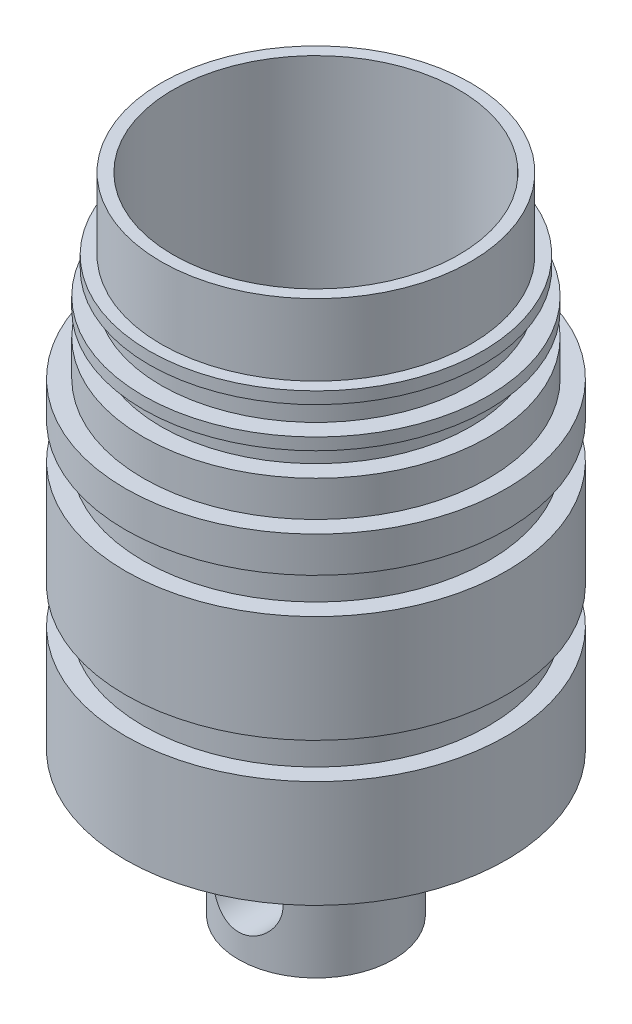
from build123d import *

# Parameters (mm, degrees)
ESQUISSE2_R             = 1.5
ENL_V_MAT_EXTRU_1_DEPTH = 5


with BuildPart() as part:
    # Esquisse1 → R_volution1 (revolve)
    with BuildSketch(Plane(origin=(0, 0, 0), x_dir=(0, 0, -1), z_dir=(1, 0, 0)), mode=Mode.PRIVATE) as r_volution1_sk:
        Polygon((6, 20.5), (6, 0), (0, -2), (0, -6.5), (3.25, -6.5), (3.25, -2.083333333), (8, -0.5), (8, 4), (7.25, 4), (7.25, 5.5), (8, 5.5), (8, 10), (7.25, 10), (7.25, 11.5), (8, 11.5), (8, 13), (7.25, 13), (7.25, 14.5), (6.5, 14.5), (6.5, 15.5), (7.25, 15.5), (7.25, 16), (6.5, 16), (6.5, 17), (7, 17), (7, 17.5), (6.5, 17.5), (6.5, 20.5), align=None)
    revolve(r_volution1_sk.sketch.rotate(Axis((0, 26.406622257, 0), (0, -1, 0)), 180), axis=Axis((0, 26.406622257, 0), (0, -1, 0)))

    # Esquisse2 → Enl_v. mat.-Extru.1 (cut, symmetric)
    with BuildSketch(Plane.XY):
        with Locations((0, -4)):
            Circle(ESQUISSE2_R)
    extrude(amount=ENL_V_MAT_EXTRU_1_DEPTH, both=True, mode=Mode.SUBTRACT)


solid = part.part
